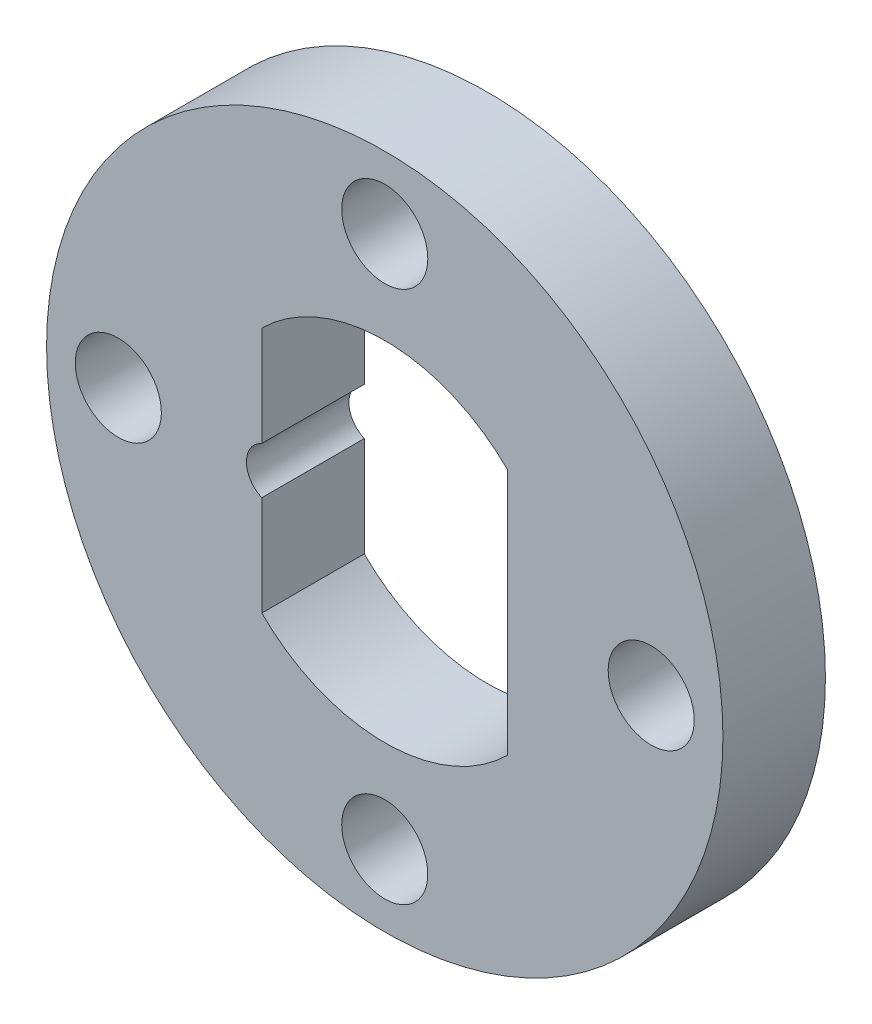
from build123d import *

# Parameters (mm, degrees)
ESQUISSE1_R                  = 16.5
EXTRUSION1_DEPTH             = 5
ESQUISSE2_R                  = 2.1
ENL_V_MAT_EXTRU_1_DEPTH      = 24.864199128
R_P_TITION_CIRCULAIRE1_COUNT = 4
ESQUISSE3_R                  = 1.25
ENL_V_MAT_EXTRU_2_DEPTH      = 24.864199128


with BuildPart() as part:
    # Esquisse1 → Extrusion1 (new body)
    with BuildSketch(Plane.XY):
        Circle(ESQUISSE1_R)
        with BuildLine():
            Line((-6, 6.020797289), (-6, -6.020797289))
            ThreePointArc((-6, -6.020797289), (0, -8.5), (6, -6.020797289))
            Line((6, -6.020797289), (6, 6.020797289))
            ThreePointArc((6, 6.020797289), (0, 8.5), (-6, 6.020797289))
        make_face(mode=Mode.SUBTRACT)
    extrude(amount=EXTRUSION1_DEPTH)

    # Esquisse2 → Enl_v. mat.-Extru.1 (cut, through all)
    with BuildSketch(Plane.XY.offset(5)):
        with Locations((0, 13)):
            Circle(ESQUISSE2_R)
    enl_v_mat_extru_1 = extrude(amount=-ENL_V_MAT_EXTRU_1_DEPTH, mode=Mode.SUBTRACT)

    # R_p_tition circulaire1: Enl_v. mat.-Extru.1 ×4 about axis
    r_p_tition_circulaire1_axis = Axis((0, 0, 0), (0, 0, 1))
    for i in range(1, R_P_TITION_CIRCULAIRE1_COUNT):
        add(enl_v_mat_extru_1.rotate(r_p_tition_circulaire1_axis, i * 360 / R_P_TITION_CIRCULAIRE1_COUNT), mode=Mode.SUBTRACT)

    # Esquisse3 → Enl_v. mat.-Extru.2 (cut, through all)
    with BuildSketch(Plane.XY.offset(5)):
        with Locations((-5.5, 0)):
            Circle(ESQUISSE3_R)
    extrude(amount=-ENL_V_MAT_EXTRU_2_DEPTH, mode=Mode.SUBTRACT)


solid = part.part
